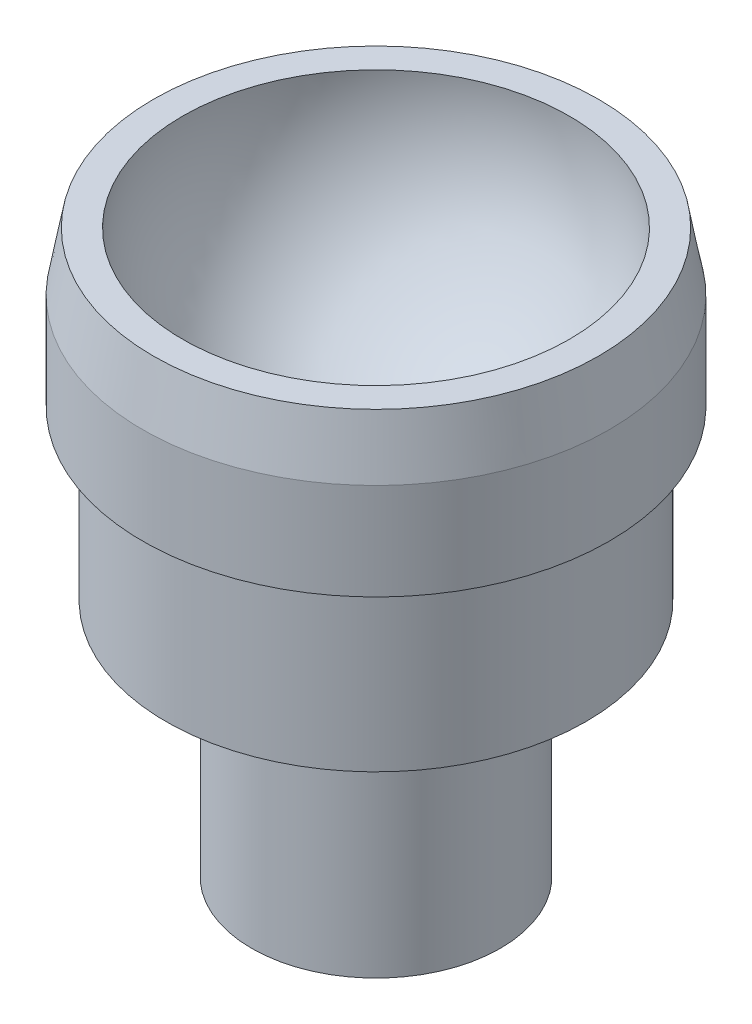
from build123d import *


with BuildPart() as part:
    # Esquisse1 → R_volution1 (revolve)
    with BuildSketch(Plane.XY):
        with BuildLine():
            Line((0, 7), (0, -16))
            Line((0, -16), (6.917323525, -16))
            Line((6.917323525, -16), (8, -15.374916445))
            Line((8, -15.374916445), (8, -2.225083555))
            Line((8, -2.225083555), (6.917323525, -1.6))
            Line((6.917323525, -1.6), (6.917323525, 0))
            Line((6.917323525, 0), (13.5, 0))
            Line((13.5, 0), (13.5, 10.8))
            Line((13.5, 10.8), (15, 10.8))
            Line((15, 10.8), (15, 17.01))
            Line((15, 17.01), (14.309088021, 20.76))
            Line((14.309088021, 20.76), (12.436333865, 20.76))
            ThreePointArc((12.436333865, 20.76), (9.273618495, 11.118472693), (0, 7))
        make_face()
    revolve(axis=Axis((0, 20.76, 0), (0, -1, 0)))


solid = part.part
